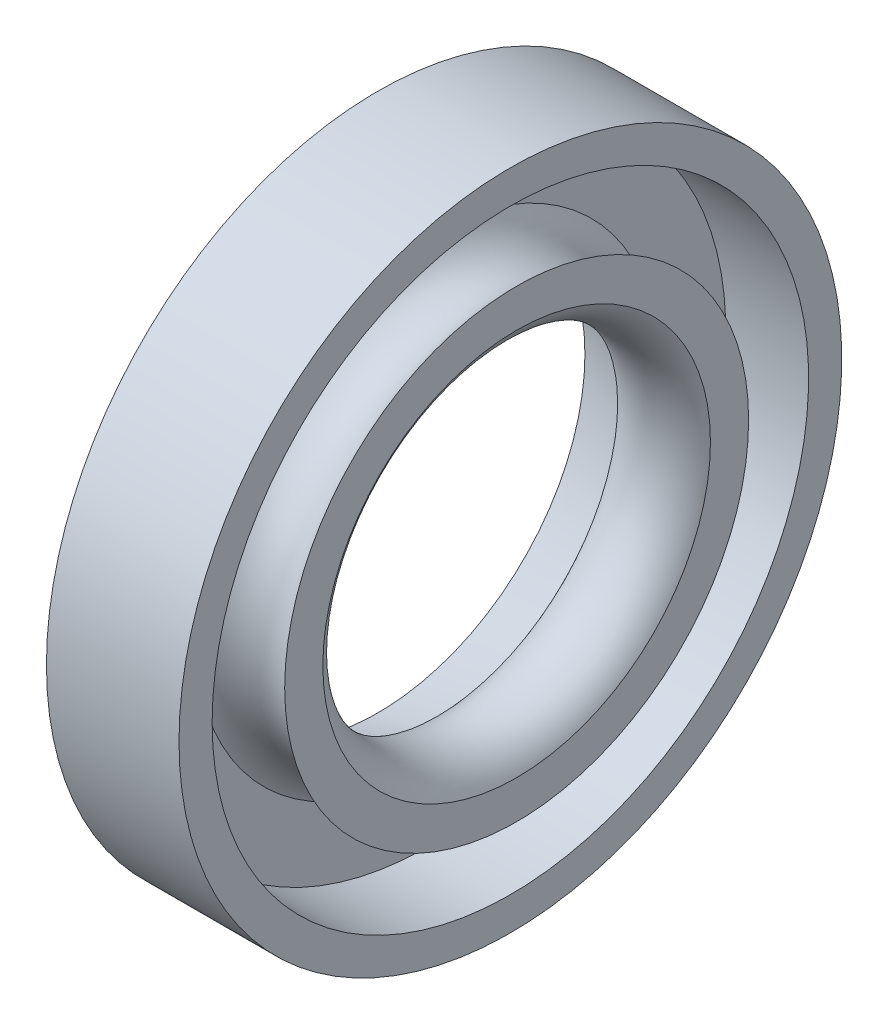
ISO-10303-21;
HEADER;
FILE_DESCRIPTION(('STEP AP214'),'2;1');
FILE_NAME('part.step','',(''),(''),'','','');
FILE_SCHEMA(('AUTOMOTIVE_DESIGN { 1 0 10303 214 1 1 1 1 }'));
ENDSEC;
DATA;
#1=APPLICATION_CONTEXT('core data for automotive mechanical design processes');
#2=APPLICATION_PROTOCOL_DEFINITION('international standard','automotive_design',2000,#1);
#3=PRODUCT_CONTEXT('',#1,'mechanical');
#4=PRODUCT('Part','Part','',(#3));
#5=PRODUCT_RELATED_PRODUCT_CATEGORY('part','',(#4));
#6=PRODUCT_DEFINITION_FORMATION('','',#4);
#7=PRODUCT_DEFINITION_CONTEXT('part definition',#1,'design');
#8=PRODUCT_DEFINITION('design','',#6,#7);
#9=PRODUCT_DEFINITION_SHAPE('','',#8);
#10=(LENGTH_UNIT() NAMED_UNIT(*) SI_UNIT(.MILLI.,.METRE.));
#11=(NAMED_UNIT(*) PLANE_ANGLE_UNIT() SI_UNIT($,.RADIAN.));
#12=(NAMED_UNIT(*) SI_UNIT($,.STERADIAN.) SOLID_ANGLE_UNIT());
#13=UNCERTAINTY_MEASURE_WITH_UNIT(LENGTH_MEASURE(1.E-05),#10,'distance_accuracy_value','');
#14=(GEOMETRIC_REPRESENTATION_CONTEXT(3) GLOBAL_UNCERTAINTY_ASSIGNED_CONTEXT((#13)) GLOBAL_UNIT_ASSIGNED_CONTEXT((#10,
#11,#12)) REPRESENTATION_CONTEXT('',''));
#15=CARTESIAN_POINT('',(0.,0.,0.));
#16=DIRECTION('',(0.,0.,1.));
#17=DIRECTION('',(1.,0.,0.));
#18=AXIS2_PLACEMENT_3D('',#15,#16,#17);
#19=CARTESIAN_POINT('',(-32.,18.,0.));
#20=DIRECTION('',(-1.,0.,0.));
#21=DIRECTION('',(0.,0.,1.));
#22=AXIS2_PLACEMENT_3D('',#19,#20,#21);
#23=PLANE('',#22);
#24=CARTESIAN_POINT('',(-32.,0.,0.));
#25=DIRECTION('',(-1.,0.,0.));
#26=DIRECTION('',(0.,0.,1.));
#27=AXIS2_PLACEMENT_3D('',#24,#25,#26);
#28=CIRCLE('',#27,20.);
#29=CARTESIAN_POINT('',(-32.,0.,20.));
#30=VERTEX_POINT('',#29);
#31=EDGE_CURVE('E46',#30,#30,#28,.T.);
#32=ORIENTED_EDGE('',*,*,#31,.F.);
#33=EDGE_LOOP('',(#32));
#34=FACE_BOUND('',#33,.T.);
#35=CARTESIAN_POINT('',(-32.,0.,0.));
#36=DIRECTION('',(-1.,0.,0.));
#37=DIRECTION('',(0.,0.,1.));
#38=AXIS2_PLACEMENT_3D('',#35,#36,#37);
#39=CIRCLE('',#38,18.);
#40=CARTESIAN_POINT('',(-32.,0.,18.));
#41=VERTEX_POINT('',#40);
#42=EDGE_CURVE('E10',#41,#41,#39,.T.);
#43=ORIENTED_EDGE('',*,*,#42,.T.);
#44=EDGE_LOOP('',(#43));
#45=FACE_BOUND('',#44,.T.);
#46=ADVANCED_FACE('F15',(#34,#45),#23,.F.);
#47=CARTESIAN_POINT('',(-120.,0.,0.));
#48=DIRECTION('',(-1.,0.,0.));
#49=DIRECTION('',(0.,0.,1.));
#50=AXIS2_PLACEMENT_3D('',#47,#48,#49);
#51=CYLINDRICAL_SURFACE('',#50,18.);
#52=ORIENTED_EDGE('',*,*,#42,.F.);
#53=EDGE_LOOP('',(#52));
#54=FACE_BOUND('',#53,.T.);
#55=CARTESIAN_POINT('',(-37.,0.,0.));
#56=DIRECTION('',(-1.,0.,0.));
#57=DIRECTION('',(0.,0.,1.));
#58=AXIS2_PLACEMENT_3D('',#55,#56,#57);
#59=CIRCLE('',#58,18.);
#60=CARTESIAN_POINT('',(-37.,0.,18.));
#61=VERTEX_POINT('',#60);
#62=EDGE_CURVE('E21',#61,#61,#59,.T.);
#63=ORIENTED_EDGE('',*,*,#62,.T.);
#64=EDGE_LOOP('',(#63));
#65=FACE_BOUND('',#64,.T.);
#66=ADVANCED_FACE('F53',(#54,#65),#51,.F.);
#67=CARTESIAN_POINT('',(-37.,14.,0.));
#68=DIRECTION('',(-1.,0.,0.));
#69=DIRECTION('',(0.,0.,1.));
#70=AXIS2_PLACEMENT_3D('',#67,#68,#69);
#71=PLANE('',#70);
#72=ORIENTED_EDGE('',*,*,#62,.F.);
#73=EDGE_LOOP('',(#72));
#74=FACE_BOUND('',#73,.T.);
#75=CARTESIAN_POINT('',(-37.,0.,0.));
#76=DIRECTION('',(-1.,0.,0.));
#77=DIRECTION('',(0.,0.,1.));
#78=AXIS2_PLACEMENT_3D('',#75,#76,#77);
#79=CIRCLE('',#78,14.);
#80=CARTESIAN_POINT('',(-37.,0.,14.));
#81=VERTEX_POINT('',#80);
#82=EDGE_CURVE('E25',#81,#81,#79,.T.);
#83=ORIENTED_EDGE('',*,*,#82,.T.);
#84=EDGE_LOOP('',(#83));
#85=FACE_BOUND('',#84,.T.);
#86=ADVANCED_FACE('F58',(#74,#85),#71,.F.);
#87=CARTESIAN_POINT('',(-34.3105288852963,0.,0.));
#88=DIRECTION('',(-1.,0.,0.));
#89=DIRECTION('',(0.,0.,1.));
#90=AXIS2_PLACEMENT_3D('',#87,#88,#89);
#91=TOROIDAL_SURFACE('',#90,15.3291896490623,3.);
#92=ORIENTED_EDGE('',*,*,#82,.F.);
#93=EDGE_LOOP('',(#92));
#94=FACE_BOUND('',#93,.T.);
#95=CARTESIAN_POINT('',(-31.6210577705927,0.,0.));
#96=DIRECTION('',(-1.,0.,0.));
#97=DIRECTION('',(0.,0.,1.));
#98=AXIS2_PLACEMENT_3D('',#95,#96,#97);
#99=CIRCLE('',#98,13.9999999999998);
#100=CARTESIAN_POINT('',(-31.6210577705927,0.,13.9999999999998));
#101=VERTEX_POINT('',#100);
#102=EDGE_CURVE('E29',#101,#101,#99,.T.);
#103=ORIENTED_EDGE('',*,*,#102,.T.);
#104=EDGE_LOOP('',(#103));
#105=FACE_BOUND('',#104,.T.);
#106=ADVANCED_FACE('F63',(#94,#105),#91,.F.);
#107=CARTESIAN_POINT('',(-31.6210577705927,11.6961524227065,0.));
#108=DIRECTION('',(-1.,0.,0.));
#109=DIRECTION('',(0.,0.,1.));
#110=AXIS2_PLACEMENT_3D('',#107,#108,#109);
#111=PLANE('',#110);
#112=ORIENTED_EDGE('',*,*,#102,.F.);
#113=EDGE_LOOP('',(#112));
#114=FACE_BOUND('',#113,.T.);
#115=CARTESIAN_POINT('',(-31.6210577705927,0.,0.));
#116=DIRECTION('',(-1.,0.,0.));
#117=DIRECTION('',(0.,0.,1.));
#118=AXIS2_PLACEMENT_3D('',#115,#116,#117);
#119=CIRCLE('',#118,11.6961524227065);
#120=CARTESIAN_POINT('',(-31.6210577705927,0.,11.6961524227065));
#121=VERTEX_POINT('',#120);
#122=EDGE_CURVE('E34',#121,#121,#119,.T.);
#123=ORIENTED_EDGE('',*,*,#122,.T.);
#124=EDGE_LOOP('',(#123));
#125=FACE_BOUND('',#124,.T.);
#126=ADVANCED_FACE('F69',(#114,#125),#111,.F.);
#127=CARTESIAN_POINT('',(-34.3105288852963,0.,0.));
#128=DIRECTION('',(-1.,0.,0.));
#129=DIRECTION('',(0.,0.,1.));
#130=AXIS2_PLACEMENT_3D('',#127,#128,#129);
#131=TOROIDAL_SURFACE('',#130,13.025342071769,3.);
#132=ORIENTED_EDGE('',*,*,#122,.F.);
#133=EDGE_LOOP('',(#132));
#134=FACE_BOUND('',#133,.T.);
#135=CARTESIAN_POINT('',(-37.,0.,0.));
#136=DIRECTION('',(-1.,0.,0.));
#137=DIRECTION('',(0.,0.,1.));
#138=AXIS2_PLACEMENT_3D('',#135,#136,#137);
#139=CIRCLE('',#138,11.6961524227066);
#140=CARTESIAN_POINT('',(-37.,0.,11.6961524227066));
#141=VERTEX_POINT('',#140);
#142=EDGE_CURVE('E37',#141,#141,#139,.T.);
#143=ORIENTED_EDGE('',*,*,#142,.T.);
#144=EDGE_LOOP('',(#143));
#145=FACE_BOUND('',#144,.T.);
#146=ADVANCED_FACE('F73',(#134,#145),#131,.T.);
#147=CARTESIAN_POINT('',(-40.,0.,0.));
#148=DIRECTION('',(-1.,0.,0.));
#149=DIRECTION('',(0.,0.,1.));
#150=AXIS2_PLACEMENT_3D('',#147,#148,#149);
#151=CONICAL_SURFACE('',#150,12.5,0.261799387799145);
#152=ORIENTED_EDGE('',*,*,#142,.F.);
#153=EDGE_LOOP('',(#152));
#154=FACE_BOUND('',#153,.T.);
#155=CARTESIAN_POINT('',(-40.,0.,0.));
#156=DIRECTION('',(-1.,0.,0.));
#157=DIRECTION('',(0.,0.,1.));
#158=AXIS2_PLACEMENT_3D('',#155,#156,#157);
#159=CIRCLE('',#158,12.5);
#160=CARTESIAN_POINT('',(-40.,0.,12.5));
#161=VERTEX_POINT('',#160);
#162=EDGE_CURVE('E40',#161,#161,#159,.T.);
#163=ORIENTED_EDGE('',*,*,#162,.T.);
#164=EDGE_LOOP('',(#163));
#165=FACE_BOUND('',#164,.T.);
#166=ADVANCED_FACE('F77',(#154,#165),#151,.F.);
#167=CARTESIAN_POINT('',(-40.,20.,0.));
#168=DIRECTION('',(1.,0.,0.));
#169=DIRECTION('',(0.,0.,-1.));
#170=AXIS2_PLACEMENT_3D('',#167,#168,#169);
#171=PLANE('',#170);
#172=ORIENTED_EDGE('',*,*,#162,.F.);
#173=EDGE_LOOP('',(#172));
#174=FACE_BOUND('',#173,.T.);
#175=CARTESIAN_POINT('',(-40.,0.,0.));
#176=DIRECTION('',(-1.,0.,0.));
#177=DIRECTION('',(0.,0.,1.));
#178=AXIS2_PLACEMENT_3D('',#175,#176,#177);
#179=CIRCLE('',#178,20.);
#180=CARTESIAN_POINT('',(-40.,0.,20.));
#181=VERTEX_POINT('',#180);
#182=EDGE_CURVE('E43',#181,#181,#179,.T.);
#183=ORIENTED_EDGE('',*,*,#182,.T.);
#184=EDGE_LOOP('',(#183));
#185=FACE_BOUND('',#184,.T.);
#186=ADVANCED_FACE('F81',(#174,#185),#171,.F.);
#187=CARTESIAN_POINT('',(-120.,0.,0.));
#188=DIRECTION('',(-1.,0.,0.));
#189=DIRECTION('',(0.,0.,1.));
#190=AXIS2_PLACEMENT_3D('',#187,#188,#189);
#191=CYLINDRICAL_SURFACE('',#190,20.);
#192=ORIENTED_EDGE('',*,*,#182,.F.);
#193=EDGE_LOOP('',(#192));
#194=FACE_BOUND('',#193,.T.);
#195=ORIENTED_EDGE('',*,*,#31,.T.);
#196=EDGE_LOOP('',(#195));
#197=FACE_BOUND('',#196,.T.);
#198=ADVANCED_FACE('F50',(#194,#197),#191,.T.);
#199=CLOSED_SHELL('',(#46,#66,#86,#106,#126,#146,#166,#186,#198));
#200=MANIFOLD_SOLID_BREP('B1',#199);
#201=ADVANCED_BREP_SHAPE_REPRESENTATION('',(#18,#200),#14);
#202=SHAPE_DEFINITION_REPRESENTATION(#9,#201);
ENDSEC;
END-ISO-10303-21;
